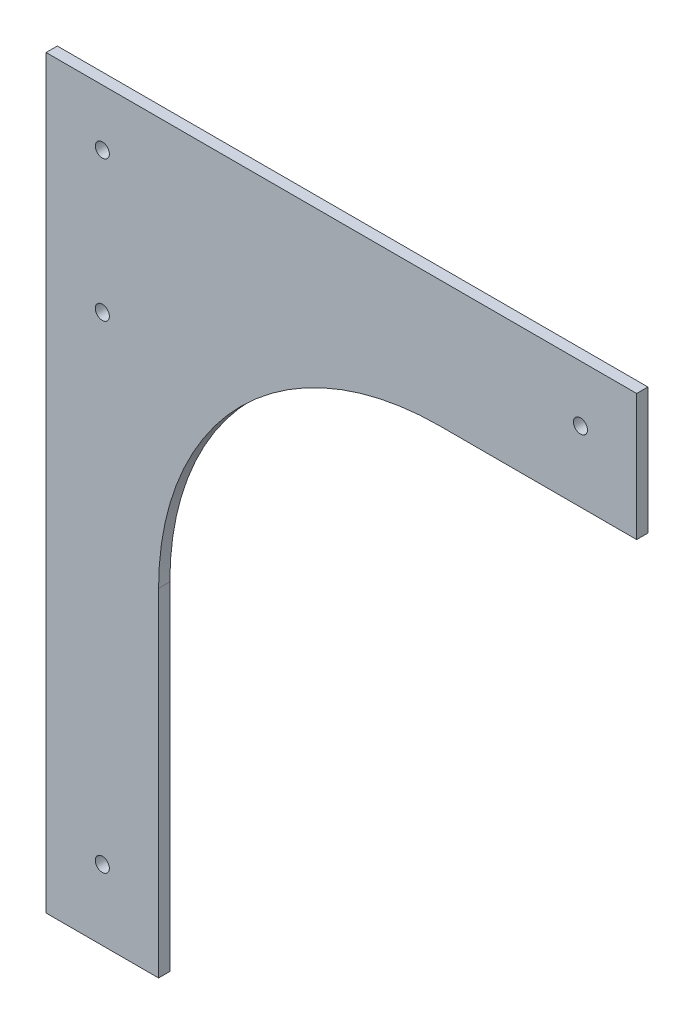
ISO-10303-21;
HEADER;
FILE_DESCRIPTION(('STEP AP214'),'2;1');
FILE_NAME('part.step','',(''),(''),'','','');
FILE_SCHEMA(('AUTOMOTIVE_DESIGN { 1 0 10303 214 1 1 1 1 }'));
ENDSEC;
DATA;
#1=APPLICATION_CONTEXT('core data for automotive mechanical design processes');
#2=APPLICATION_PROTOCOL_DEFINITION('international standard','automotive_design',2000,#1);
#3=PRODUCT_CONTEXT('',#1,'mechanical');
#4=PRODUCT('Part','Part','',(#3));
#5=PRODUCT_RELATED_PRODUCT_CATEGORY('part','',(#4));
#6=PRODUCT_DEFINITION_FORMATION('','',#4);
#7=PRODUCT_DEFINITION_CONTEXT('part definition',#1,'design');
#8=PRODUCT_DEFINITION('design','',#6,#7);
#9=PRODUCT_DEFINITION_SHAPE('','',#8);
#10=(LENGTH_UNIT() NAMED_UNIT(*) SI_UNIT(.MILLI.,.METRE.));
#11=(NAMED_UNIT(*) PLANE_ANGLE_UNIT() SI_UNIT($,.RADIAN.));
#12=(NAMED_UNIT(*) SI_UNIT($,.STERADIAN.) SOLID_ANGLE_UNIT());
#13=UNCERTAINTY_MEASURE_WITH_UNIT(LENGTH_MEASURE(1.E-05),#10,'distance_accuracy_value','');
#14=(GEOMETRIC_REPRESENTATION_CONTEXT(3) GLOBAL_UNCERTAINTY_ASSIGNED_CONTEXT((#13)) GLOBAL_UNIT_ASSIGNED_CONTEXT((#10,
#11,#12)) REPRESENTATION_CONTEXT('',''));
#15=CARTESIAN_POINT('',(0.,0.,0.));
#16=DIRECTION('',(0.,0.,1.));
#17=DIRECTION('',(1.,0.,0.));
#18=AXIS2_PLACEMENT_3D('',#15,#16,#17);
#19=CARTESIAN_POINT('',(-41.2555368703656,5.99999999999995,2.4));
#20=DIRECTION('',(0.,0.,-1.));
#21=DIRECTION('',(-1.,0.,0.));
#22=AXIS2_PLACEMENT_3D('',#19,#20,#21);
#23=CYLINDRICAL_SURFACE('',#22,60.);
#24=CARTESIAN_POINT('',(-41.2555368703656,5.99999999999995,0.));
#25=DIRECTION('',(0.,0.,1.));
#26=DIRECTION('',(1.,0.,0.));
#27=AXIS2_PLACEMENT_3D('',#24,#25,#26);
#28=CIRCLE('',#27,60.);
#29=CARTESIAN_POINT('',(-41.2555368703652,65.9999999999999,0.));
#30=VERTEX_POINT('',#29);
#31=CARTESIAN_POINT('',(-101.255536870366,5.99999999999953,0.));
#32=VERTEX_POINT('',#31);
#33=EDGE_CURVE('E134',#30,#32,#28,.T.);
#34=ORIENTED_EDGE('',*,*,#33,.F.);
#35=DIRECTION('',(0.,0.,-1.));
#36=VECTOR('',#35,1.);
#37=CARTESIAN_POINT('',(-41.2555368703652,65.9999999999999,2.4));
#38=LINE('',#37,#36);
#39=CARTESIAN_POINT('',(-41.2555368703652,65.9999999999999,2.4));
#40=VERTEX_POINT('',#39);
#41=EDGE_CURVE('E11',#40,#30,#38,.T.);
#42=ORIENTED_EDGE('',*,*,#41,.F.);
#43=CARTESIAN_POINT('',(-41.2555368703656,5.99999999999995,2.4));
#44=DIRECTION('',(0.,0.,1.));
#45=DIRECTION('',(1.,0.,0.));
#46=AXIS2_PLACEMENT_3D('',#43,#44,#45);
#47=CIRCLE('',#46,60.);
#48=CARTESIAN_POINT('',(-101.255536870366,5.99999999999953,2.4));
#49=VERTEX_POINT('',#48);
#50=EDGE_CURVE('E162',#40,#49,#47,.T.);
#51=ORIENTED_EDGE('',*,*,#50,.T.);
#52=DIRECTION('',(0.,0.,-1.));
#53=VECTOR('',#52,1.);
#54=CARTESIAN_POINT('',(-101.255536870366,5.99999999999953,2.4));
#55=LINE('',#54,#53);
#56=EDGE_CURVE('E48',#49,#32,#55,.T.);
#57=ORIENTED_EDGE('',*,*,#56,.T.);
#58=EDGE_LOOP('',(#34,#42,#51,#57));
#59=FACE_BOUND('',#58,.T.);
#60=ADVANCED_FACE('F32',(#59),#23,.F.);
#61=CARTESIAN_POINT('',(0.,65.9999999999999,2.4));
#62=DIRECTION('',(0.,1.,0.));
#63=DIRECTION('',(0.,0.,1.));
#64=AXIS2_PLACEMENT_3D('',#61,#62,#63);
#65=PLANE('',#64);
#66=DIRECTION('',(1.,0.,0.));
#67=VECTOR('',#66,1.);
#68=CARTESIAN_POINT('',(0.,65.9999999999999,0.));
#69=LINE('',#68,#67);
#70=CARTESIAN_POINT('',(0.744463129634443,65.9999999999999,0.));
#71=VERTEX_POINT('',#70);
#72=EDGE_CURVE('E136',#30,#71,#69,.T.);
#73=ORIENTED_EDGE('',*,*,#72,.T.);
#74=DIRECTION('',(0.,0.,-1.));
#75=VECTOR('',#74,1.);
#76=CARTESIAN_POINT('',(0.744463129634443,65.9999999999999,2.4));
#77=LINE('',#76,#75);
#78=CARTESIAN_POINT('',(0.744463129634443,65.9999999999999,2.4));
#79=VERTEX_POINT('',#78);
#80=EDGE_CURVE('E40',#79,#71,#77,.T.);
#81=ORIENTED_EDGE('',*,*,#80,.F.);
#82=DIRECTION('',(1.,0.,0.));
#83=VECTOR('',#82,1.);
#84=CARTESIAN_POINT('',(0.,65.9999999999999,2.4));
#85=LINE('',#84,#83);
#86=EDGE_CURVE('E315',#40,#79,#85,.T.);
#87=ORIENTED_EDGE('',*,*,#86,.F.);
#88=ORIENTED_EDGE('',*,*,#41,.T.);
#89=EDGE_LOOP('',(#73,#81,#87,#88));
#90=FACE_BOUND('',#89,.T.);
#91=ADVANCED_FACE('F189',(#90),#65,.F.);
#92=CARTESIAN_POINT('',(0.744463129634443,0.,2.4));
#93=DIRECTION('',(-1.,0.,0.));
#94=DIRECTION('',(0.,0.,1.));
#95=AXIS2_PLACEMENT_3D('',#92,#93,#94);
#96=PLANE('',#95);
#97=DIRECTION('',(0.,1.,0.));
#98=VECTOR('',#97,1.);
#99=CARTESIAN_POINT('',(0.744463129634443,0.,0.));
#100=LINE('',#99,#98);
#101=CARTESIAN_POINT('',(0.744463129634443,92.9999999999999,0.));
#102=VERTEX_POINT('',#101);
#103=EDGE_CURVE('E138',#71,#102,#100,.T.);
#104=ORIENTED_EDGE('',*,*,#103,.T.);
#105=DIRECTION('',(0.,0.,-1.));
#106=VECTOR('',#105,1.);
#107=CARTESIAN_POINT('',(0.744463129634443,92.9999999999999,2.4));
#108=LINE('',#107,#106);
#109=CARTESIAN_POINT('',(0.744463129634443,92.9999999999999,2.4));
#110=VERTEX_POINT('',#109);
#111=EDGE_CURVE('E166',#110,#102,#108,.T.);
#112=ORIENTED_EDGE('',*,*,#111,.F.);
#113=DIRECTION('',(0.,1.,0.));
#114=VECTOR('',#113,1.);
#115=CARTESIAN_POINT('',(0.744463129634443,0.,2.4));
#116=LINE('',#115,#114);
#117=EDGE_CURVE('E117',#79,#110,#116,.T.);
#118=ORIENTED_EDGE('',*,*,#117,.F.);
#119=ORIENTED_EDGE('',*,*,#80,.T.);
#120=EDGE_LOOP('',(#104,#112,#118,#119));
#121=FACE_BOUND('',#120,.T.);
#122=ADVANCED_FACE('F172',(#121),#96,.F.);
#123=CARTESIAN_POINT('',(0.,92.9999999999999,2.4));
#124=DIRECTION('',(0.,1.,0.));
#125=DIRECTION('',(0.,0.,1.));
#126=AXIS2_PLACEMENT_3D('',#123,#124,#125);
#127=PLANE('',#126);
#128=DIRECTION('',(1.,0.,0.));
#129=VECTOR('',#128,1.);
#130=CARTESIAN_POINT('',(0.,92.9999999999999,0.));
#131=LINE('',#130,#129);
#132=CARTESIAN_POINT('',(-125.255536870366,92.9999999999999,0.));
#133=VERTEX_POINT('',#132);
#134=EDGE_CURVE('E141',#133,#102,#131,.T.);
#135=ORIENTED_EDGE('',*,*,#134,.F.);
#136=DIRECTION('',(0.,0.,-1.));
#137=VECTOR('',#136,1.);
#138=CARTESIAN_POINT('',(-125.255536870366,92.9999999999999,2.4));
#139=LINE('',#138,#137);
#140=CARTESIAN_POINT('',(-125.255536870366,92.9999999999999,2.4));
#141=VERTEX_POINT('',#140);
#142=EDGE_CURVE('E102',#141,#133,#139,.T.);
#143=ORIENTED_EDGE('',*,*,#142,.F.);
#144=DIRECTION('',(1.,0.,0.));
#145=VECTOR('',#144,1.);
#146=CARTESIAN_POINT('',(0.,92.9999999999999,2.4));
#147=LINE('',#146,#145);
#148=EDGE_CURVE('E115',#141,#110,#147,.T.);
#149=ORIENTED_EDGE('',*,*,#148,.T.);
#150=ORIENTED_EDGE('',*,*,#111,.T.);
#151=EDGE_LOOP('',(#135,#143,#149,#150));
#152=FACE_BOUND('',#151,.T.);
#153=ADVANCED_FACE('F181',(#152),#127,.T.);
#154=CARTESIAN_POINT('',(-125.255536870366,0.,2.4));
#155=DIRECTION('',(-1.,0.,0.));
#156=DIRECTION('',(0.,0.,1.));
#157=AXIS2_PLACEMENT_3D('',#154,#155,#156);
#158=PLANE('',#157);
#159=DIRECTION('',(0.,1.,0.));
#160=VECTOR('',#159,1.);
#161=CARTESIAN_POINT('',(-125.255536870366,0.,0.));
#162=LINE('',#161,#160);
#163=CARTESIAN_POINT('',(-125.255536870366,-66.0000000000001,0.));
#164=VERTEX_POINT('',#163);
#165=EDGE_CURVE('E99',#164,#133,#162,.T.);
#166=ORIENTED_EDGE('',*,*,#165,.F.);
#167=DIRECTION('',(0.,0.,-1.));
#168=VECTOR('',#167,1.);
#169=CARTESIAN_POINT('',(-125.255536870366,-66.0000000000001,2.4));
#170=LINE('',#169,#168);
#171=CARTESIAN_POINT('',(-125.255536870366,-66.0000000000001,2.4));
#172=VERTEX_POINT('',#171);
#173=EDGE_CURVE('E93',#172,#164,#170,.T.);
#174=ORIENTED_EDGE('',*,*,#173,.F.);
#175=DIRECTION('',(0.,1.,0.));
#176=VECTOR('',#175,1.);
#177=CARTESIAN_POINT('',(-125.255536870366,0.,2.4));
#178=LINE('',#177,#176);
#179=EDGE_CURVE('E97',#172,#141,#178,.T.);
#180=ORIENTED_EDGE('',*,*,#179,.T.);
#181=ORIENTED_EDGE('',*,*,#142,.T.);
#182=EDGE_LOOP('',(#166,#174,#180,#181));
#183=FACE_BOUND('',#182,.T.);
#184=ADVANCED_FACE('F95',(#183),#158,.T.);
#185=CARTESIAN_POINT('',(0.,-66.0000000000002,2.4));
#186=DIRECTION('',(0.,1.,0.));
#187=DIRECTION('',(-1.,0.,0.));
#188=AXIS2_PLACEMENT_3D('',#185,#186,#187);
#189=PLANE('',#188);
#190=DIRECTION('',(1.,0.,0.));
#191=VECTOR('',#190,1.);
#192=CARTESIAN_POINT('',(0.,-66.0000000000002,0.));
#193=LINE('',#192,#191);
#194=CARTESIAN_POINT('',(-101.255536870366,-66.0000000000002,0.));
#195=VERTEX_POINT('',#194);
#196=EDGE_CURVE('E145',#164,#195,#193,.T.);
#197=ORIENTED_EDGE('',*,*,#196,.T.);
#198=DIRECTION('',(0.,0.,-1.));
#199=VECTOR('',#198,1.);
#200=CARTESIAN_POINT('',(-101.255536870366,-66.0000000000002,2.4));
#201=LINE('',#200,#199);
#202=CARTESIAN_POINT('',(-101.255536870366,-66.0000000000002,2.4));
#203=VERTEX_POINT('',#202);
#204=EDGE_CURVE('E71',#203,#195,#201,.T.);
#205=ORIENTED_EDGE('',*,*,#204,.F.);
#206=DIRECTION('',(1.,0.,0.));
#207=VECTOR('',#206,1.);
#208=CARTESIAN_POINT('',(0.,-66.0000000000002,2.4));
#209=LINE('',#208,#207);
#210=EDGE_CURVE('E104',#172,#203,#209,.T.);
#211=ORIENTED_EDGE('',*,*,#210,.F.);
#212=ORIENTED_EDGE('',*,*,#173,.T.);
#213=EDGE_LOOP('',(#197,#205,#211,#212));
#214=FACE_BOUND('',#213,.T.);
#215=ADVANCED_FACE('F105',(#214),#189,.F.);
#216=CARTESIAN_POINT('',(-113.255536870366,51.,2.4));
#217=DIRECTION('',(0.,0.,-1.));
#218=DIRECTION('',(-1.,0.,0.));
#219=AXIS2_PLACEMENT_3D('',#216,#217,#218);
#220=CYLINDRICAL_SURFACE('',#219,1.5);
#221=CARTESIAN_POINT('',(-113.255536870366,51.,2.4));
#222=DIRECTION('',(0.,0.,1.));
#223=DIRECTION('',(1.,0.,0.));
#224=AXIS2_PLACEMENT_3D('',#221,#222,#223);
#225=CIRCLE('',#224,1.5);
#226=CARTESIAN_POINT('',(-111.755536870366,51.,2.4));
#227=VERTEX_POINT('',#226);
#228=EDGE_CURVE('E128',#227,#227,#225,.T.);
#229=ORIENTED_EDGE('',*,*,#228,.T.);
#230=EDGE_LOOP('',(#229));
#231=FACE_BOUND('',#230,.T.);
#232=CARTESIAN_POINT('',(-113.255536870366,51.,0.));
#233=DIRECTION('',(0.,0.,1.));
#234=DIRECTION('',(1.,0.,0.));
#235=AXIS2_PLACEMENT_3D('',#232,#233,#234);
#236=CIRCLE('',#235,1.5);
#237=CARTESIAN_POINT('',(-111.755536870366,51.,0.));
#238=VERTEX_POINT('',#237);
#239=EDGE_CURVE('E156',#238,#238,#236,.T.);
#240=ORIENTED_EDGE('',*,*,#239,.F.);
#241=EDGE_LOOP('',(#240));
#242=FACE_BOUND('',#241,.T.);
#243=ADVANCED_FACE('F212',(#231,#242),#220,.F.);
#244=CARTESIAN_POINT('',(-113.255536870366,80.9999999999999,2.4));
#245=DIRECTION('',(0.,0.,-1.));
#246=DIRECTION('',(-1.,0.,0.));
#247=AXIS2_PLACEMENT_3D('',#244,#245,#246);
#248=CYLINDRICAL_SURFACE('',#247,1.5);
#249=CARTESIAN_POINT('',(-113.255536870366,80.9999999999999,2.4));
#250=DIRECTION('',(0.,0.,1.));
#251=DIRECTION('',(1.,0.,0.));
#252=AXIS2_PLACEMENT_3D('',#249,#250,#251);
#253=CIRCLE('',#252,1.5);
#254=CARTESIAN_POINT('',(-111.755536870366,80.9999999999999,2.4));
#255=VERTEX_POINT('',#254);
#256=EDGE_CURVE('E125',#255,#255,#253,.T.);
#257=ORIENTED_EDGE('',*,*,#256,.T.);
#258=EDGE_LOOP('',(#257));
#259=FACE_BOUND('',#258,.T.);
#260=CARTESIAN_POINT('',(-113.255536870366,80.9999999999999,0.));
#261=DIRECTION('',(0.,0.,1.));
#262=DIRECTION('',(1.,0.,0.));
#263=AXIS2_PLACEMENT_3D('',#260,#261,#262);
#264=CIRCLE('',#263,1.5);
#265=CARTESIAN_POINT('',(-111.755536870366,80.9999999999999,0.));
#266=VERTEX_POINT('',#265);
#267=EDGE_CURVE('E153',#266,#266,#264,.T.);
#268=ORIENTED_EDGE('',*,*,#267,.F.);
#269=EDGE_LOOP('',(#268));
#270=FACE_BOUND('',#269,.T.);
#271=ADVANCED_FACE('F206',(#259,#270),#248,.F.);
#272=CARTESIAN_POINT('',(-11.2555368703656,80.9999999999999,2.4));
#273=DIRECTION('',(0.,0.,-1.));
#274=DIRECTION('',(-1.,0.,0.));
#275=AXIS2_PLACEMENT_3D('',#272,#273,#274);
#276=CYLINDRICAL_SURFACE('',#275,1.5);
#277=CARTESIAN_POINT('',(-11.2555368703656,80.9999999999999,2.4));
#278=DIRECTION('',(0.,0.,1.));
#279=DIRECTION('',(1.,0.,0.));
#280=AXIS2_PLACEMENT_3D('',#277,#278,#279);
#281=CIRCLE('',#280,1.5);
#282=CARTESIAN_POINT('',(-9.75553687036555,80.9999999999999,2.4));
#283=VERTEX_POINT('',#282);
#284=EDGE_CURVE('E122',#283,#283,#281,.F.);
#285=ORIENTED_EDGE('',*,*,#284,.F.);
#286=EDGE_LOOP('',(#285));
#287=FACE_BOUND('',#286,.T.);
#288=CARTESIAN_POINT('',(-11.2555368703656,80.9999999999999,0.));
#289=DIRECTION('',(0.,0.,1.));
#290=DIRECTION('',(1.,0.,0.));
#291=AXIS2_PLACEMENT_3D('',#288,#289,#290);
#292=CIRCLE('',#291,1.5);
#293=CARTESIAN_POINT('',(-9.75553687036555,80.9999999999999,0.));
#294=VERTEX_POINT('',#293);
#295=EDGE_CURVE('E150',#294,#294,#292,.F.);
#296=ORIENTED_EDGE('',*,*,#295,.T.);
#297=EDGE_LOOP('',(#296));
#298=FACE_BOUND('',#297,.T.);
#299=ADVANCED_FACE('F198',(#287,#298),#276,.F.);
#300=CARTESIAN_POINT('',(-101.255536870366,0.,2.4));
#301=DIRECTION('',(1.,0.,0.));
#302=DIRECTION('',(0.,1.,0.));
#303=AXIS2_PLACEMENT_3D('',#300,#301,#302);
#304=PLANE('',#303);
#305=DIRECTION('',(0.,-1.,0.));
#306=VECTOR('',#305,1.);
#307=CARTESIAN_POINT('',(-101.255536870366,0.,0.));
#308=LINE('',#307,#306);
#309=EDGE_CURVE('E147',#32,#195,#308,.T.);
#310=ORIENTED_EDGE('',*,*,#309,.F.);
#311=ORIENTED_EDGE('',*,*,#56,.F.);
#312=DIRECTION('',(0.,-1.,0.));
#313=VECTOR('',#312,1.);
#314=CARTESIAN_POINT('',(-101.255536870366,0.,2.4));
#315=LINE('',#314,#313);
#316=EDGE_CURVE('E108',#49,#203,#315,.T.);
#317=ORIENTED_EDGE('',*,*,#316,.T.);
#318=ORIENTED_EDGE('',*,*,#204,.T.);
#319=EDGE_LOOP('',(#310,#311,#317,#318));
#320=FACE_BOUND('',#319,.T.);
#321=ADVANCED_FACE('F195',(#320),#304,.T.);
#322=CARTESIAN_POINT('',(-113.255536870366,-51.,2.4));
#323=DIRECTION('',(0.,0.,-1.));
#324=DIRECTION('',(-1.,0.,0.));
#325=AXIS2_PLACEMENT_3D('',#322,#323,#324);
#326=CYLINDRICAL_SURFACE('',#325,1.5);
#327=CARTESIAN_POINT('',(-113.255536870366,-51.,2.4));
#328=DIRECTION('',(0.,0.,1.));
#329=DIRECTION('',(1.,0.,0.));
#330=AXIS2_PLACEMENT_3D('',#327,#328,#329);
#331=CIRCLE('',#330,1.5);
#332=CARTESIAN_POINT('',(-111.755536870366,-51.,2.4));
#333=VERTEX_POINT('',#332);
#334=EDGE_CURVE('E131',#333,#333,#331,.F.);
#335=ORIENTED_EDGE('',*,*,#334,.F.);
#336=EDGE_LOOP('',(#335));
#337=FACE_BOUND('',#336,.T.);
#338=CARTESIAN_POINT('',(-113.255536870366,-51.,0.));
#339=DIRECTION('',(0.,0.,1.));
#340=DIRECTION('',(1.,0.,0.));
#341=AXIS2_PLACEMENT_3D('',#338,#339,#340);
#342=CIRCLE('',#341,1.5);
#343=CARTESIAN_POINT('',(-111.755536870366,-51.,0.));
#344=VERTEX_POINT('',#343);
#345=EDGE_CURVE('E159',#344,#344,#342,.F.);
#346=ORIENTED_EDGE('',*,*,#345,.T.);
#347=EDGE_LOOP('',(#346));
#348=FACE_BOUND('',#347,.T.);
#349=ADVANCED_FACE('F197',(#337,#348),#326,.F.);
#350=CARTESIAN_POINT('',(0.,0.,2.4));
#351=DIRECTION('',(0.,0.,1.));
#352=DIRECTION('',(1.,0.,0.));
#353=AXIS2_PLACEMENT_3D('',#350,#351,#352);
#354=PLANE('',#353);
#355=ORIENTED_EDGE('',*,*,#50,.F.);
#356=ORIENTED_EDGE('',*,*,#86,.T.);
#357=ORIENTED_EDGE('',*,*,#117,.T.);
#358=ORIENTED_EDGE('',*,*,#148,.F.);
#359=ORIENTED_EDGE('',*,*,#179,.F.);
#360=ORIENTED_EDGE('',*,*,#210,.T.);
#361=ORIENTED_EDGE('',*,*,#316,.F.);
#362=EDGE_LOOP('',(#355,#356,#357,#358,#359,#360,#361));
#363=FACE_BOUND('',#362,.T.);
#364=ORIENTED_EDGE('',*,*,#284,.T.);
#365=EDGE_LOOP('',(#364));
#366=FACE_BOUND('',#365,.T.);
#367=ORIENTED_EDGE('',*,*,#256,.F.);
#368=EDGE_LOOP('',(#367));
#369=FACE_BOUND('',#368,.T.);
#370=ORIENTED_EDGE('',*,*,#228,.F.);
#371=EDGE_LOOP('',(#370));
#372=FACE_BOUND('',#371,.T.);
#373=ORIENTED_EDGE('',*,*,#334,.T.);
#374=EDGE_LOOP('',(#373));
#375=FACE_BOUND('',#374,.T.);
#376=ADVANCED_FACE('F112',(#363,#366,#369,#372,#375),#354,.T.);
#377=CARTESIAN_POINT('',(0.,0.,0.));
#378=DIRECTION('',(0.,0.,1.));
#379=DIRECTION('',(1.,0.,0.));
#380=AXIS2_PLACEMENT_3D('',#377,#378,#379);
#381=PLANE('',#380);
#382=ORIENTED_EDGE('',*,*,#33,.T.);
#383=ORIENTED_EDGE('',*,*,#309,.T.);
#384=ORIENTED_EDGE('',*,*,#196,.F.);
#385=ORIENTED_EDGE('',*,*,#165,.T.);
#386=ORIENTED_EDGE('',*,*,#134,.T.);
#387=ORIENTED_EDGE('',*,*,#103,.F.);
#388=ORIENTED_EDGE('',*,*,#72,.F.);
#389=EDGE_LOOP('',(#382,#383,#384,#385,#386,#387,#388));
#390=FACE_BOUND('',#389,.T.);
#391=ORIENTED_EDGE('',*,*,#295,.F.);
#392=EDGE_LOOP('',(#391));
#393=FACE_BOUND('',#392,.T.);
#394=ORIENTED_EDGE('',*,*,#267,.T.);
#395=EDGE_LOOP('',(#394));
#396=FACE_BOUND('',#395,.T.);
#397=ORIENTED_EDGE('',*,*,#239,.T.);
#398=EDGE_LOOP('',(#397));
#399=FACE_BOUND('',#398,.T.);
#400=ORIENTED_EDGE('',*,*,#345,.F.);
#401=EDGE_LOOP('',(#400));
#402=FACE_BOUND('',#401,.T.);
#403=ADVANCED_FACE('F177',(#390,#393,#396,#399,#402),#381,.F.);
#404=CLOSED_SHELL('',(#60,#91,#122,#153,#184,#215,#243,#271,#299,#321,#349,#376,#403));
#405=MANIFOLD_SOLID_BREP('B2',#404);
#406=ADVANCED_BREP_SHAPE_REPRESENTATION('',(#18,#405),#14);
#407=SHAPE_DEFINITION_REPRESENTATION(#9,#406);
ENDSEC;
END-ISO-10303-21;
